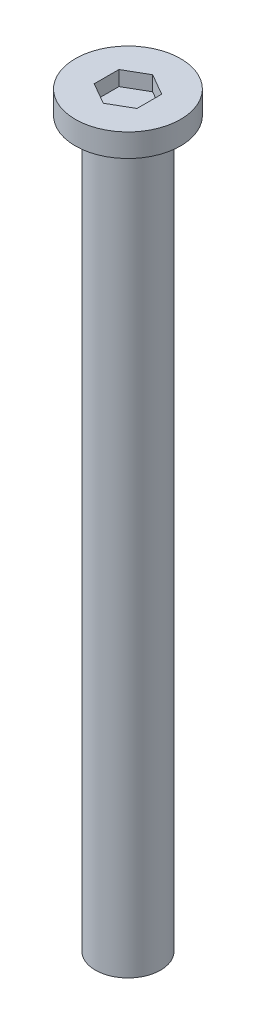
ISO-10303-21;
HEADER;
FILE_DESCRIPTION(('STEP AP214'),'2;1');
FILE_NAME('part.step','',(''),(''),'','','');
FILE_SCHEMA(('AUTOMOTIVE_DESIGN { 1 0 10303 214 1 1 1 1 }'));
ENDSEC;
DATA;
#1=APPLICATION_CONTEXT('core data for automotive mechanical design processes');
#2=APPLICATION_PROTOCOL_DEFINITION('international standard','automotive_design',2000,#1);
#3=PRODUCT_CONTEXT('',#1,'mechanical');
#4=PRODUCT('Part','Part','',(#3));
#5=PRODUCT_RELATED_PRODUCT_CATEGORY('part','',(#4));
#6=PRODUCT_DEFINITION_FORMATION('','',#4);
#7=PRODUCT_DEFINITION_CONTEXT('part definition',#1,'design');
#8=PRODUCT_DEFINITION('design','',#6,#7);
#9=PRODUCT_DEFINITION_SHAPE('','',#8);
#10=(LENGTH_UNIT() NAMED_UNIT(*) SI_UNIT(.MILLI.,.METRE.));
#11=(NAMED_UNIT(*) PLANE_ANGLE_UNIT() SI_UNIT($,.RADIAN.));
#12=(NAMED_UNIT(*) SI_UNIT($,.STERADIAN.) SOLID_ANGLE_UNIT());
#13=UNCERTAINTY_MEASURE_WITH_UNIT(LENGTH_MEASURE(1.E-05),#10,'distance_accuracy_value','');
#14=(GEOMETRIC_REPRESENTATION_CONTEXT(3) GLOBAL_UNCERTAINTY_ASSIGNED_CONTEXT((#13)) GLOBAL_UNIT_ASSIGNED_CONTEXT((#10,
#11,#12)) REPRESENTATION_CONTEXT('',''));
#15=CARTESIAN_POINT('',(0.,0.,0.));
#16=DIRECTION('',(0.,0.,1.));
#17=DIRECTION('',(1.,0.,0.));
#18=AXIS2_PLACEMENT_3D('',#15,#16,#17);
#19=CARTESIAN_POINT('',(0.,0.25,0.));
#20=DIRECTION('',(0.,-1.,0.));
#21=DIRECTION('',(0.,0.,-1.));
#22=AXIS2_PLACEMENT_3D('',#19,#20,#21);
#23=PLANE('',#22);
#24=DIRECTION('',(-0.866025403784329,0.,-0.50000000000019));
#25=VECTOR('',#24,1.);
#26=CARTESIAN_POINT('',(0.,0.25,-0.750555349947));
#27=LINE('',#26,#25);
#28=CARTESIAN_POINT('',(0.65000000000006,0.25,-0.375277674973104));
#29=VERTEX_POINT('',#28);
#30=CARTESIAN_POINT('',(0.,0.25,-0.750555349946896));
#31=VERTEX_POINT('',#30);
#32=EDGE_CURVE('E125',#29,#31,#27,.T.);
#33=ORIENTED_EDGE('',*,*,#32,.T.);
#34=DIRECTION('',(-0.866025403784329,0.,0.50000000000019));
#35=VECTOR('',#34,1.);
#36=CARTESIAN_POINT('',(-0.65,0.25,-0.375277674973));
#37=LINE('',#36,#35);
#38=CARTESIAN_POINT('',(-0.65,0.25,-0.375277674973));
#39=VERTEX_POINT('',#38);
#40=EDGE_CURVE('E129',#31,#39,#37,.T.);
#41=ORIENTED_EDGE('',*,*,#40,.T.);
#42=DIRECTION('',(0.,0.,1.));
#43=VECTOR('',#42,1.);
#44=CARTESIAN_POINT('',(-0.65,0.25,0.375277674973));
#45=LINE('',#44,#43);
#46=CARTESIAN_POINT('',(-0.65000000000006,0.25,0.375277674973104));
#47=VERTEX_POINT('',#46);
#48=EDGE_CURVE('E67',#39,#47,#45,.T.);
#49=ORIENTED_EDGE('',*,*,#48,.T.);
#50=DIRECTION('',(0.866025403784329,0.,0.50000000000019));
#51=VECTOR('',#50,1.);
#52=CARTESIAN_POINT('',(0.,0.25,0.750555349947));
#53=LINE('',#52,#51);
#54=CARTESIAN_POINT('',(0.,0.25,0.750555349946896));
#55=VERTEX_POINT('',#54);
#56=EDGE_CURVE('E69',#47,#55,#53,.T.);
#57=ORIENTED_EDGE('',*,*,#56,.T.);
#58=DIRECTION('',(0.866025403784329,0.,-0.50000000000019));
#59=VECTOR('',#58,1.);
#60=CARTESIAN_POINT('',(0.65,0.25,0.375277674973));
#61=LINE('',#60,#59);
#62=CARTESIAN_POINT('',(0.65,0.25,0.375277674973));
#63=VERTEX_POINT('',#62);
#64=EDGE_CURVE('E71',#55,#63,#61,.T.);
#65=ORIENTED_EDGE('',*,*,#64,.T.);
#66=DIRECTION('',(0.,0.,-1.));
#67=VECTOR('',#66,1.);
#68=CARTESIAN_POINT('',(0.65,0.25,-0.375277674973));
#69=LINE('',#68,#67);
#70=EDGE_CURVE('E121',#63,#29,#69,.T.);
#71=ORIENTED_EDGE('',*,*,#70,.T.);
#72=EDGE_LOOP('',(#33,#41,#49,#57,#65,#71));
#73=FACE_BOUND('',#72,.T.);
#74=ADVANCED_FACE('F16',(#73),#23,.F.);
#75=CARTESIAN_POINT('',(0.65,0.25,0.375277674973));
#76=DIRECTION('',(0.50000000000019,0.,0.866025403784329));
#77=DIRECTION('',(0.866025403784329,0.,-0.50000000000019));
#78=AXIS2_PLACEMENT_3D('',#75,#76,#77);
#79=PLANE('',#78);
#80=DIRECTION('',(-0.86602540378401,0.,0.500000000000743));
#81=VECTOR('',#80,1.);
#82=CARTESIAN_POINT('',(0.65,0.7,0.375277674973));
#83=LINE('',#82,#81);
#84=CARTESIAN_POINT('',(0.65,0.7,0.375277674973));
#85=VERTEX_POINT('',#84);
#86=CARTESIAN_POINT('',(-1.19776953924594E-13,0.7,0.750555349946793));
#87=VERTEX_POINT('',#86);
#88=EDGE_CURVE('E117',#85,#87,#83,.T.);
#89=ORIENTED_EDGE('',*,*,#88,.F.);
#90=DIRECTION('',(0.,1.,0.));
#91=VECTOR('',#90,1.);
#92=CARTESIAN_POINT('',(0.65,0.25,0.375277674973));
#93=LINE('',#92,#91);
#94=EDGE_CURVE('E82',#85,#63,#93,.F.);
#95=ORIENTED_EDGE('',*,*,#94,.T.);
#96=ORIENTED_EDGE('',*,*,#64,.F.);
#97=DIRECTION('',(0.,1.,0.));
#98=VECTOR('',#97,1.);
#99=CARTESIAN_POINT('',(0.,0.25,0.750555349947));
#100=LINE('',#99,#98);
#101=EDGE_CURVE('E76',#55,#87,#100,.T.);
#102=ORIENTED_EDGE('',*,*,#101,.T.);
#103=EDGE_LOOP('',(#89,#95,#96,#102));
#104=FACE_BOUND('',#103,.T.);
#105=ADVANCED_FACE('F79',(#104),#79,.F.);
#106=CARTESIAN_POINT('',(0.,0.25,0.750555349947));
#107=DIRECTION('',(-0.50000000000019,0.,0.866025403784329));
#108=DIRECTION('',(0.866025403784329,0.,0.50000000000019));
#109=AXIS2_PLACEMENT_3D('',#106,#107,#108);
#110=PLANE('',#109);
#111=DIRECTION('',(-0.86602540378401,0.,-0.500000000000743));
#112=VECTOR('',#111,1.);
#113=CARTESIAN_POINT('',(0.,0.7,0.750555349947));
#114=LINE('',#113,#112);
#115=CARTESIAN_POINT('',(-0.65000000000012,0.7,0.375277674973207));
#116=VERTEX_POINT('',#115);
#117=EDGE_CURVE('E87',#87,#116,#114,.T.);
#118=ORIENTED_EDGE('',*,*,#117,.F.);
#119=ORIENTED_EDGE('',*,*,#101,.F.);
#120=ORIENTED_EDGE('',*,*,#56,.F.);
#121=DIRECTION('',(0.,1.,0.));
#122=VECTOR('',#121,1.);
#123=CARTESIAN_POINT('',(-0.65,0.25,0.375277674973));
#124=LINE('',#123,#122);
#125=EDGE_CURVE('E90',#47,#116,#124,.T.);
#126=ORIENTED_EDGE('',*,*,#125,.T.);
#127=EDGE_LOOP('',(#118,#119,#120,#126));
#128=FACE_BOUND('',#127,.T.);
#129=ADVANCED_FACE('F85',(#128),#110,.F.);
#130=CARTESIAN_POINT('',(-0.65,0.25,0.375277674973));
#131=DIRECTION('',(-1.,0.,0.));
#132=DIRECTION('',(0.,0.,1.));
#133=AXIS2_PLACEMENT_3D('',#130,#131,#132);
#134=PLANE('',#133);
#135=DIRECTION('',(0.,0.,1.));
#136=VECTOR('',#135,1.);
#137=CARTESIAN_POINT('',(-0.65,0.7,0.));
#138=LINE('',#137,#136);
#139=CARTESIAN_POINT('',(-0.65,0.7,-0.375277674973));
#140=VERTEX_POINT('',#139);
#141=EDGE_CURVE('E113',#116,#140,#138,.F.);
#142=ORIENTED_EDGE('',*,*,#141,.F.);
#143=ORIENTED_EDGE('',*,*,#125,.F.);
#144=ORIENTED_EDGE('',*,*,#48,.F.);
#145=DIRECTION('',(0.,1.,0.));
#146=VECTOR('',#145,1.);
#147=CARTESIAN_POINT('',(-0.65,0.25,-0.375277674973));
#148=LINE('',#147,#146);
#149=EDGE_CURVE('E127',#39,#140,#148,.T.);
#150=ORIENTED_EDGE('',*,*,#149,.T.);
#151=EDGE_LOOP('',(#142,#143,#144,#150));
#152=FACE_BOUND('',#151,.T.);
#153=ADVANCED_FACE('F132',(#152),#134,.F.);
#154=CARTESIAN_POINT('',(-0.65,0.25,-0.375277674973));
#155=DIRECTION('',(-0.50000000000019,0.,-0.866025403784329));
#156=DIRECTION('',(-0.866025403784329,0.,0.50000000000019));
#157=AXIS2_PLACEMENT_3D('',#154,#155,#156);
#158=PLANE('',#157);
#159=DIRECTION('',(0.86602540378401,0.,-0.500000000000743));
#160=VECTOR('',#159,1.);
#161=CARTESIAN_POINT('',(-0.65,0.7,-0.375277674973));
#162=LINE('',#161,#160);
#163=CARTESIAN_POINT('',(1.19609708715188E-13,0.7,-0.750555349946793));
#164=VERTEX_POINT('',#163);
#165=EDGE_CURVE('E108',#140,#164,#162,.T.);
#166=ORIENTED_EDGE('',*,*,#165,.F.);
#167=ORIENTED_EDGE('',*,*,#149,.F.);
#168=ORIENTED_EDGE('',*,*,#40,.F.);
#169=DIRECTION('',(0.,1.,0.));
#170=VECTOR('',#169,1.);
#171=CARTESIAN_POINT('',(0.,0.25,-0.750555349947));
#172=LINE('',#171,#170);
#173=EDGE_CURVE('E123',#31,#164,#172,.T.);
#174=ORIENTED_EDGE('',*,*,#173,.T.);
#175=EDGE_LOOP('',(#166,#167,#168,#174));
#176=FACE_BOUND('',#175,.T.);
#177=ADVANCED_FACE('F143',(#176),#158,.F.);
#178=CARTESIAN_POINT('',(0.,0.25,-0.750555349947));
#179=DIRECTION('',(0.50000000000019,0.,-0.866025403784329));
#180=DIRECTION('',(-0.866025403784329,0.,-0.50000000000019));
#181=AXIS2_PLACEMENT_3D('',#178,#179,#180);
#182=PLANE('',#181);
#183=DIRECTION('',(0.86602540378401,0.,0.500000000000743));
#184=VECTOR('',#183,1.);
#185=CARTESIAN_POINT('',(0.,0.7,-0.750555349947));
#186=LINE('',#185,#184);
#187=CARTESIAN_POINT('',(0.65000000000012,0.7,-0.375277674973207));
#188=VERTEX_POINT('',#187);
#189=EDGE_CURVE('E104',#164,#188,#186,.T.);
#190=ORIENTED_EDGE('',*,*,#189,.F.);
#191=ORIENTED_EDGE('',*,*,#173,.F.);
#192=ORIENTED_EDGE('',*,*,#32,.F.);
#193=DIRECTION('',(0.,1.,0.));
#194=VECTOR('',#193,1.);
#195=CARTESIAN_POINT('',(0.65,0.25,-0.375277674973));
#196=LINE('',#195,#194);
#197=EDGE_CURVE('E34',#29,#188,#196,.T.);
#198=ORIENTED_EDGE('',*,*,#197,.T.);
#199=EDGE_LOOP('',(#190,#191,#192,#198));
#200=FACE_BOUND('',#199,.T.);
#201=ADVANCED_FACE('F141',(#200),#182,.F.);
#202=CARTESIAN_POINT('',(0.65,0.25,-0.375277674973));
#203=DIRECTION('',(1.,0.,0.));
#204=DIRECTION('',(0.,0.,-1.));
#205=AXIS2_PLACEMENT_3D('',#202,#203,#204);
#206=PLANE('',#205);
#207=DIRECTION('',(0.,0.,1.));
#208=VECTOR('',#207,1.);
#209=CARTESIAN_POINT('',(0.65,0.7,0.));
#210=LINE('',#209,#208);
#211=EDGE_CURVE('E100',#188,#85,#210,.T.);
#212=ORIENTED_EDGE('',*,*,#211,.F.);
#213=ORIENTED_EDGE('',*,*,#197,.F.);
#214=ORIENTED_EDGE('',*,*,#70,.F.);
#215=ORIENTED_EDGE('',*,*,#94,.F.);
#216=EDGE_LOOP('',(#212,#213,#214,#215));
#217=FACE_BOUND('',#216,.T.);
#218=ADVANCED_FACE('F138',(#217),#206,.F.);
#219=CARTESIAN_POINT('',(0.,0.7,0.));
#220=DIRECTION('',(0.,1.,0.));
#221=DIRECTION('',(0.,0.,1.));
#222=AXIS2_PLACEMENT_3D('',#219,#220,#221);
#223=PLANE('',#222);
#224=ORIENTED_EDGE('',*,*,#189,.T.);
#225=ORIENTED_EDGE('',*,*,#211,.T.);
#226=ORIENTED_EDGE('',*,*,#88,.T.);
#227=ORIENTED_EDGE('',*,*,#117,.T.);
#228=ORIENTED_EDGE('',*,*,#141,.T.);
#229=ORIENTED_EDGE('',*,*,#165,.T.);
#230=EDGE_LOOP('',(#224,#225,#226,#227,#228,#229));
#231=FACE_BOUND('',#230,.T.);
#232=CARTESIAN_POINT('',(0.,0.7,0.));
#233=DIRECTION('',(0.,1.,0.));
#234=DIRECTION('',(0.,0.,1.));
#235=AXIS2_PLACEMENT_3D('',#232,#233,#234);
#236=CIRCLE('',#235,1.6);
#237=CARTESIAN_POINT('',(0.,0.7,1.6));
#238=VERTEX_POINT('',#237);
#239=EDGE_CURVE('E19',#238,#238,#236,.F.);
#240=ORIENTED_EDGE('',*,*,#239,.F.);
#241=EDGE_LOOP('',(#240));
#242=FACE_BOUND('',#241,.T.);
#243=ADVANCED_FACE('F135',(#231,#242),#223,.T.);
#244=CARTESIAN_POINT('',(0.,0.,0.));
#245=DIRECTION('',(0.,1.,0.));
#246=DIRECTION('',(0.,0.,1.));
#247=AXIS2_PLACEMENT_3D('',#244,#245,#246);
#248=CYLINDRICAL_SURFACE('',#247,1.6);
#249=CARTESIAN_POINT('',(0.,0.,0.));
#250=DIRECTION('',(0.,1.,0.));
#251=DIRECTION('',(0.,0.,1.));
#252=AXIS2_PLACEMENT_3D('',#249,#250,#251);
#253=CIRCLE('',#252,1.6);
#254=CARTESIAN_POINT('',(0.,0.,1.6));
#255=VERTEX_POINT('',#254);
#256=EDGE_CURVE('E95',#255,#255,#253,.T.);
#257=ORIENTED_EDGE('',*,*,#256,.T.);
#258=EDGE_LOOP('',(#257));
#259=FACE_BOUND('',#258,.T.);
#260=ORIENTED_EDGE('',*,*,#239,.T.);
#261=EDGE_LOOP('',(#260));
#262=FACE_BOUND('',#261,.T.);
#263=ADVANCED_FACE('F168',(#259,#262),#248,.T.);
#264=CARTESIAN_POINT('',(0.,0.,0.));
#265=DIRECTION('',(0.,1.,0.));
#266=DIRECTION('',(0.,0.,1.));
#267=AXIS2_PLACEMENT_3D('',#264,#265,#266);
#268=PLANE('',#267);
#269=CARTESIAN_POINT('',(0.,0.,0.));
#270=DIRECTION('',(0.,1.,0.));
#271=DIRECTION('',(0.,0.,1.));
#272=AXIS2_PLACEMENT_3D('',#269,#270,#271);
#273=CIRCLE('',#272,0.99);
#274=CARTESIAN_POINT('',(0.,0.,0.99));
#275=VERTEX_POINT('',#274);
#276=EDGE_CURVE('E25',#275,#275,#273,.F.);
#277=ORIENTED_EDGE('',*,*,#276,.F.);
#278=EDGE_LOOP('',(#277));
#279=FACE_BOUND('',#278,.T.);
#280=ORIENTED_EDGE('',*,*,#256,.F.);
#281=EDGE_LOOP('',(#280));
#282=FACE_BOUND('',#281,.T.);
#283=ADVANCED_FACE('F161',(#279,#282),#268,.F.);
#284=CARTESIAN_POINT('',(0.,-22.,0.));
#285=DIRECTION('',(0.,1.,0.));
#286=DIRECTION('',(0.,0.,1.));
#287=AXIS2_PLACEMENT_3D('',#284,#285,#286);
#288=PLANE('',#287);
#289=CARTESIAN_POINT('',(0.,-22.,0.));
#290=DIRECTION('',(0.,1.,0.));
#291=DIRECTION('',(0.,0.,1.));
#292=AXIS2_PLACEMENT_3D('',#289,#290,#291);
#293=CIRCLE('',#292,0.99);
#294=CARTESIAN_POINT('',(0.,-22.,0.99));
#295=VERTEX_POINT('',#294);
#296=EDGE_CURVE('E10',#295,#295,#293,.T.);
#297=ORIENTED_EDGE('',*,*,#296,.F.);
#298=EDGE_LOOP('',(#297));
#299=FACE_BOUND('',#298,.T.);
#300=ADVANCED_FACE('F155',(#299),#288,.F.);
#301=CARTESIAN_POINT('',(0.,-22.,0.));
#302=DIRECTION('',(0.,1.,0.));
#303=DIRECTION('',(0.,0.,1.));
#304=AXIS2_PLACEMENT_3D('',#301,#302,#303);
#305=CYLINDRICAL_SURFACE('',#304,0.99);
#306=ORIENTED_EDGE('',*,*,#296,.T.);
#307=EDGE_LOOP('',(#306));
#308=FACE_BOUND('',#307,.T.);
#309=ORIENTED_EDGE('',*,*,#276,.T.);
#310=EDGE_LOOP('',(#309));
#311=FACE_BOUND('',#310,.T.);
#312=ADVANCED_FACE('F153',(#308,#311),#305,.T.);
#313=CLOSED_SHELL('',(#74,#105,#129,#153,#177,#201,#218,#243,#263,#283,#300,#312));
#314=MANIFOLD_SOLID_BREP('B1',#313);
#315=ADVANCED_BREP_SHAPE_REPRESENTATION('',(#18,#314),#14);
#316=SHAPE_DEFINITION_REPRESENTATION(#9,#315);
ENDSEC;
END-ISO-10303-21;
